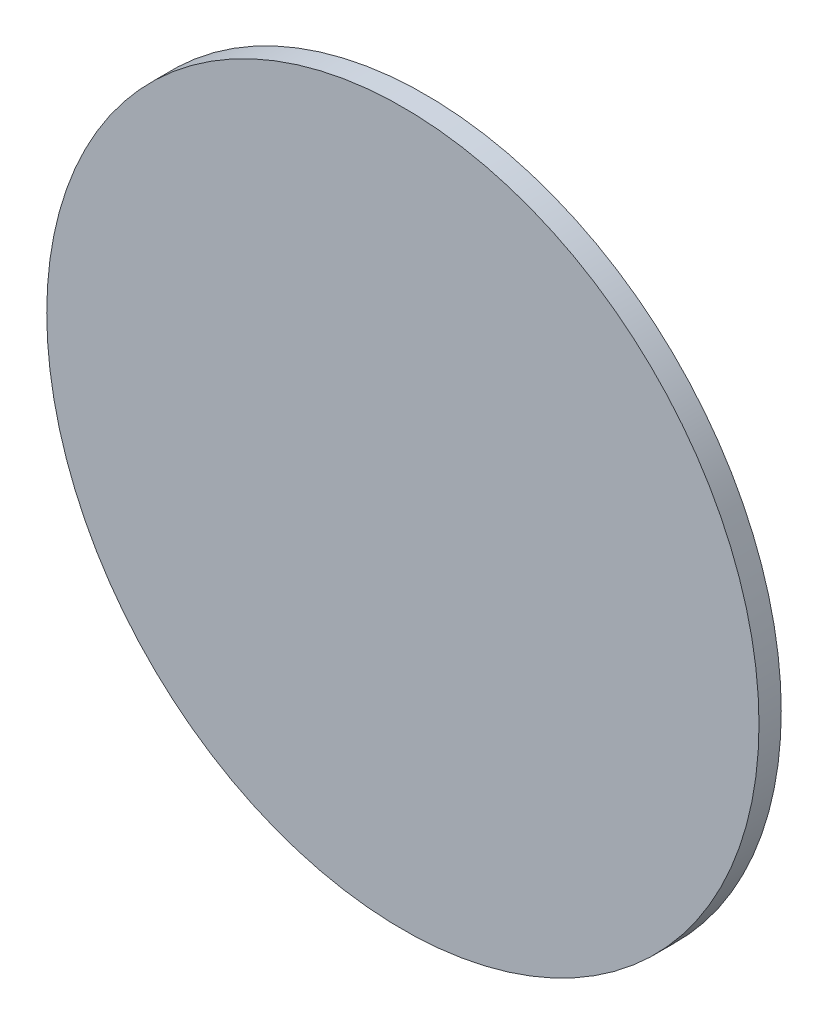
ISO-10303-21;
HEADER;
FILE_DESCRIPTION(('STEP AP214'),'2;1');
FILE_NAME('part.step','',(''),(''),'','','');
FILE_SCHEMA(('AUTOMOTIVE_DESIGN { 1 0 10303 214 1 1 1 1 }'));
ENDSEC;
DATA;
#1=APPLICATION_CONTEXT('core data for automotive mechanical design processes');
#2=APPLICATION_PROTOCOL_DEFINITION('international standard','automotive_design',2000,#1);
#3=PRODUCT_CONTEXT('',#1,'mechanical');
#4=PRODUCT('Part','Part','',(#3));
#5=PRODUCT_RELATED_PRODUCT_CATEGORY('part','',(#4));
#6=PRODUCT_DEFINITION_FORMATION('','',#4);
#7=PRODUCT_DEFINITION_CONTEXT('part definition',#1,'design');
#8=PRODUCT_DEFINITION('design','',#6,#7);
#9=PRODUCT_DEFINITION_SHAPE('','',#8);
#10=(LENGTH_UNIT() NAMED_UNIT(*) SI_UNIT(.MILLI.,.METRE.));
#11=(NAMED_UNIT(*) PLANE_ANGLE_UNIT() SI_UNIT($,.RADIAN.));
#12=(NAMED_UNIT(*) SI_UNIT($,.STERADIAN.) SOLID_ANGLE_UNIT());
#13=UNCERTAINTY_MEASURE_WITH_UNIT(LENGTH_MEASURE(1.E-05),#10,'distance_accuracy_value','');
#14=(GEOMETRIC_REPRESENTATION_CONTEXT(3) GLOBAL_UNCERTAINTY_ASSIGNED_CONTEXT((#13)) GLOBAL_UNIT_ASSIGNED_CONTEXT((#10,
#11,#12)) REPRESENTATION_CONTEXT('',''));
#15=CARTESIAN_POINT('',(0.,0.,0.));
#16=DIRECTION('',(0.,0.,1.));
#17=DIRECTION('',(1.,0.,0.));
#18=AXIS2_PLACEMENT_3D('',#15,#16,#17);
#19=CARTESIAN_POINT('',(0.,0.,1.));
#20=DIRECTION('',(0.,0.,-1.));
#21=DIRECTION('',(-1.,0.,0.));
#22=AXIS2_PLACEMENT_3D('',#19,#20,#21);
#23=CYLINDRICAL_SURFACE('',#22,16.);
#24=CARTESIAN_POINT('',(0.,0.,1.));
#25=DIRECTION('',(0.,0.,1.));
#26=DIRECTION('',(1.,0.,0.));
#27=AXIS2_PLACEMENT_3D('',#24,#25,#26);
#28=CIRCLE('',#27,16.);
#29=CARTESIAN_POINT('',(16.,0.,1.));
#30=VERTEX_POINT('',#29);
#31=EDGE_CURVE('E10',#30,#30,#28,.T.);
#32=ORIENTED_EDGE('',*,*,#31,.F.);
#33=EDGE_LOOP('',(#32));
#34=FACE_BOUND('',#33,.T.);
#35=CARTESIAN_POINT('',(0.,0.,0.));
#36=DIRECTION('',(0.,0.,1.));
#37=DIRECTION('',(1.,0.,0.));
#38=AXIS2_PLACEMENT_3D('',#35,#36,#37);
#39=CIRCLE('',#38,16.);
#40=CARTESIAN_POINT('',(16.,0.,0.));
#41=VERTEX_POINT('',#40);
#42=EDGE_CURVE('E33',#41,#41,#39,.T.);
#43=ORIENTED_EDGE('',*,*,#42,.T.);
#44=EDGE_LOOP('',(#43));
#45=FACE_BOUND('',#44,.T.);
#46=ADVANCED_FACE('F30',(#34,#45),#23,.T.);
#47=CARTESIAN_POINT('',(0.,0.,1.));
#48=DIRECTION('',(0.,0.,1.));
#49=DIRECTION('',(1.,0.,0.));
#50=AXIS2_PLACEMENT_3D('',#47,#48,#49);
#51=PLANE('',#50);
#52=ORIENTED_EDGE('',*,*,#31,.T.);
#53=EDGE_LOOP('',(#52));
#54=FACE_BOUND('',#53,.T.);
#55=ADVANCED_FACE('F45',(#54),#51,.T.);
#56=CARTESIAN_POINT('',(0.,0.,0.));
#57=DIRECTION('',(0.,0.,1.));
#58=DIRECTION('',(1.,0.,0.));
#59=AXIS2_PLACEMENT_3D('',#56,#57,#58);
#60=PLANE('',#59);
#61=ORIENTED_EDGE('',*,*,#42,.F.);
#62=EDGE_LOOP('',(#61));
#63=FACE_BOUND('',#62,.T.);
#64=ADVANCED_FACE('F43',(#63),#60,.F.);
#65=CLOSED_SHELL('',(#46,#55,#64));
#66=MANIFOLD_SOLID_BREP('B2',#65);
#67=ADVANCED_BREP_SHAPE_REPRESENTATION('',(#18,#66),#14);
#68=SHAPE_DEFINITION_REPRESENTATION(#9,#67);
ENDSEC;
END-ISO-10303-21;
